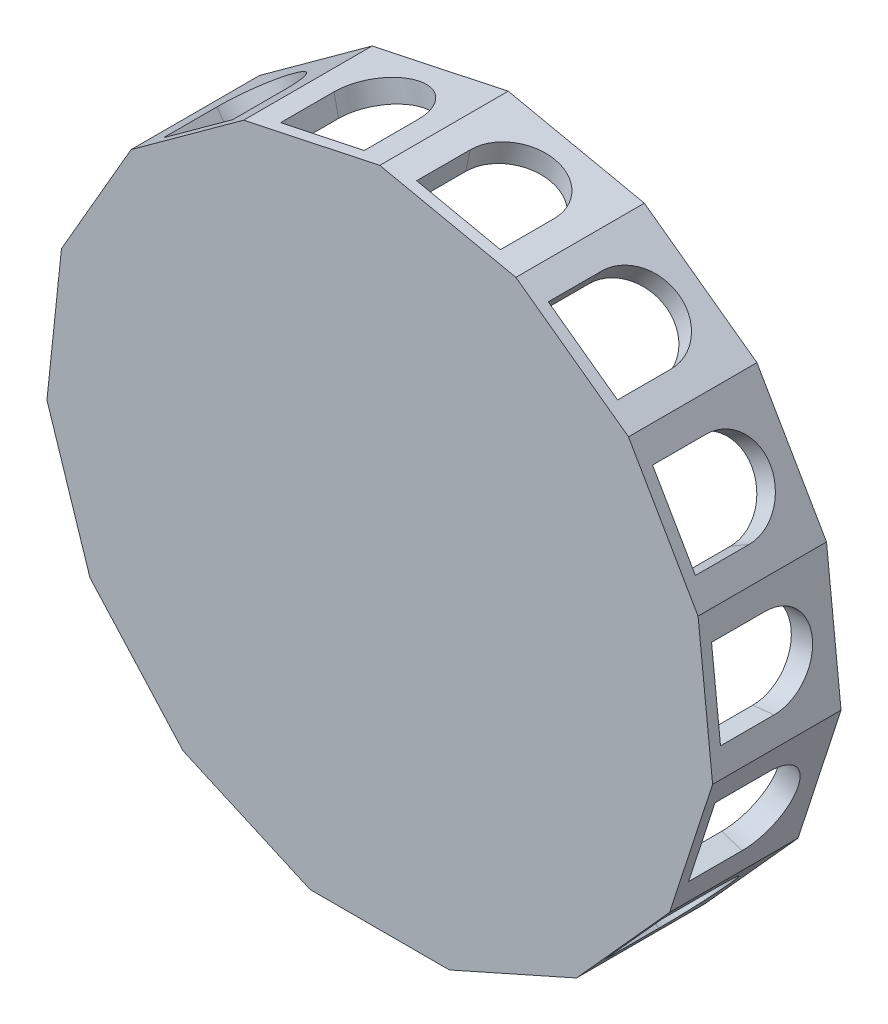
from build123d import *

# Parameters (mm, degrees)
BOSS_EXTRUDE1_DEPTH = 120
CUT_EXTRUDE1_DEPTH  = 50
CIRPATTERN6_COUNT   = 15
CUT_EXTRUDE2_DEPTH  = 457.957911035
CIRPATTERN7_COUNT   = 15
BOSS_EXTRUDE2_DEPTH = 10
SCALE1_SCALE        = 7.375


with BuildPart() as part:
    # Sketch1 → Boss-Extrude1 (new body)
    with BuildSketch(Plane.XY):
        Polygon((232.331397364, 209.192129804), (127.159188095, 285.604212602), (0, 312.632732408), (-127.159188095, 285.604212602), (-232.331397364, 209.192129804), (-297.331397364, 96.608827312), (-310.920097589, -32.679019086), (-270.74788832, -156.316366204), (-183.760909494, -252.925193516), (-65, -305.800957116), (65, -305.800957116), (183.760909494, -252.925193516), (270.74788832, -156.316366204), (310.920097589, -32.679019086), (297.331397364, 96.608827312), align=None)
    extrude(amount=-BOSS_EXTRUDE1_DEPTH)

    # Sketch2 → Cut-Extrude1 (cut, symmetric)
    with BuildSketch(Plane(origin=(-425.211299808, 319.073132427, 0), x_dir=(0, 0, 1), z_dir=(0.9510565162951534, 0.30901699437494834, 0))):
        with BuildLine():
            Line((0, 474.85409961), (-60, 474.85409961))
            ThreePointArc((-60, 474.85409961), (-100, 434.85409961), (-60, 394.85409961))
            Line((-60, 394.85409961), (0, 394.85409961))
            Line((0, 394.85409961), (0, 474.85409961))
        make_face()
    cut_extrude1 = extrude(amount=CUT_EXTRUDE1_DEPTH, both=True, mode=Mode.SUBTRACT)

    # CirPattern6: Cut-Extrude1 ×15 about axis
    cirpattern6_axis = Axis((0, 0, 0), (0, 0, 1))
    for i in range(1, CIRPATTERN6_COUNT):
        add(cut_extrude1.rotate(cirpattern6_axis, i * 360 / CIRPATTERN6_COUNT), mode=Mode.SUBTRACT)

    # Sketch3 → Cut-Extrude2 (cut, through all)
    with BuildSketch(Plane.XY):
        Polygon((0, 0), (-118.842720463, 266.92512047), (0, 292.185920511), align=None)
    cut_extrude2 = extrude(amount=-CUT_EXTRUDE2_DEPTH, mode=Mode.SUBTRACT)

    # CirPattern7: Cut-Extrude2 ×15 about axis
    cirpattern7_axis = Axis((0, 0, 0), (0, 0, 1))
    for i in range(1, CIRPATTERN7_COUNT):
        add(cut_extrude2.rotate(cirpattern7_axis, i * 360 / CIRPATTERN7_COUNT), mode=Mode.SUBTRACT)

    # Sketch4 → Boss-Extrude2 (add)
    with BuildSketch(Plane.XY):
        Polygon((-232.331397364, 209.192129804), (-127.159188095, 285.604212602), (0, 312.632732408), (127.159188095, 285.604212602), (232.331397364, 209.192129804), (297.331397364, 96.608827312), (310.920097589, -32.679019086), (270.74788832, -156.316366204), (183.760909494, -252.925193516), (65, -305.800957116), (-65, -305.800957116), (-183.760909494, -252.925193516), (-270.74788832, -156.316366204), (-310.920097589, -32.679019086), (-297.331397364, 96.608827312), align=None)
    extrude(amount=-BOSS_EXTRUDE2_DEPTH)


with BuildPart() as part_1:
    # Scale1: scaled about (0, 0, -35.655757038)
    add(part.part.scale(SCALE1_SCALE).moved(Location((0, 0, 227.305451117))))


solid = part_1.part
